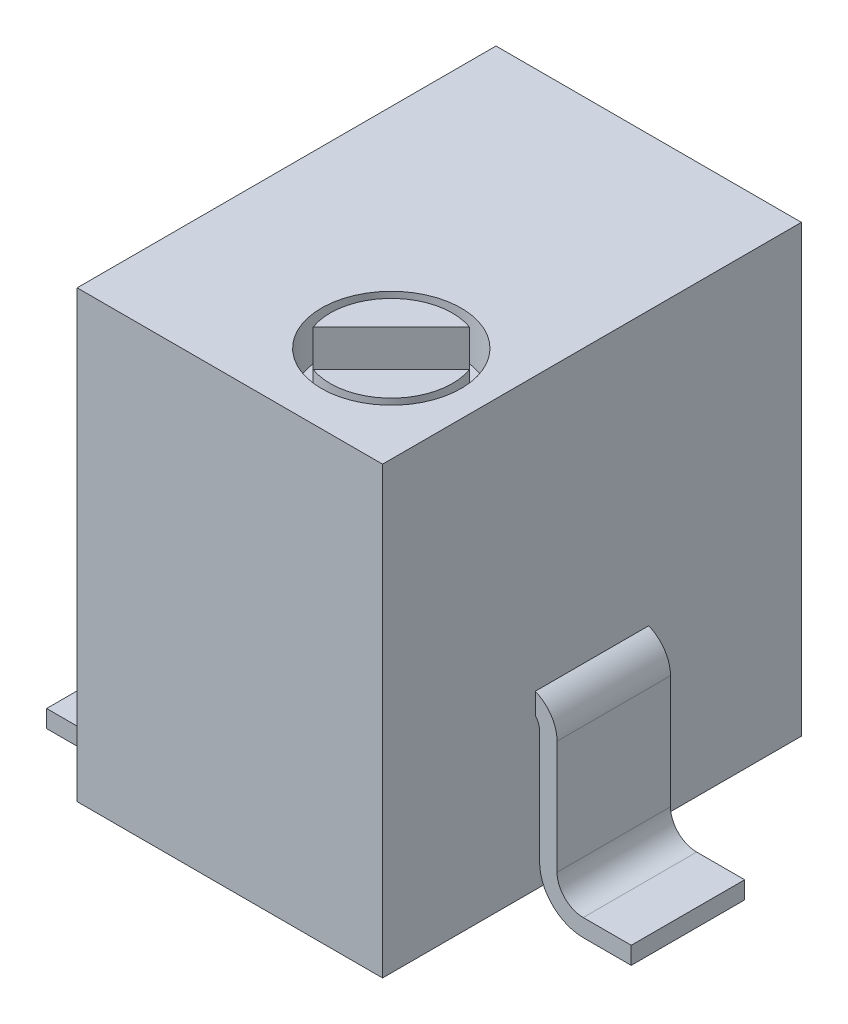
from build123d import *

# Parameters (mm, degrees)
EXTRUDE_1_DEPTH     = 1.65
EXTRUDE_START       = 0.2
SKETCH_2_W          = 3.5
SKETCH_2_H          = 4.8
EXTRUDE_2_DEPTH     = 5.1
SKETCH_3_W          = 1.1
SKETCH_3_H          = 1.7
SKETCH_3_H_2        = 1
CUT_EXTRUDE_1_DEPTH = 7.47861868
SKETCH_4_R          = 0.8
CUT_EXTRUDE_2_DEPTH = 0.5


with BuildPart() as part:
    # Sketch 1 → Extrude 1 (new, symmetric)
    with BuildSketch(Plane.XY):
        with BuildLine():
            Line((-2.85, 0), (-2.3, 0))
            ThreePointArc((-2.3, 0), (-1.946446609, 0.146446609), (-1.8, 0.5))
            Line((-1.8, 0.5), (-1.8, 1.8))
            ThreePointArc((-1.8, 1.8), (-1.741421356, 1.941421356), (-1.6, 2))
            Line((-1.6, 2), (1.6, 2))
            ThreePointArc((1.6, 2), (1.741421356, 1.941421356), (1.8, 1.8))
            Line((1.8, 1.8), (1.8, 0.5))
            ThreePointArc((1.8, 0.5), (1.946446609, 0.146446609), (2.3, 0))
            Line((2.3, 0), (2.85, 0))
            Line((2.85, 0), (2.85, 0.2))
            Line((2.85, 0.2), (2.3, 0.2))
            ThreePointArc((2.3, 0.2), (2.087867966, 0.287867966), (2, 0.5))
            Line((2, 0.5), (2, 1.8))
            ThreePointArc((2, 1.8), (1.882842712, 2.082842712), (1.6, 2.2))
            Line((1.6, 2.2), (-1.6, 2.2))
            ThreePointArc((-1.6, 2.2), (-1.882842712, 2.082842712), (-2, 1.8))
            Line((-2, 1.8), (-2, 0.5))
            ThreePointArc((-2, 0.5), (-2.087867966, 0.287867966), (-2.3, 0.2))
            Line((-2.3, 0.2), (-2.85, 0.2))
            Line((-2.85, 0.2), (-2.85, 0))
        make_face()
    extrude(amount=EXTRUDE_1_DEPTH, both=True)

    # Sketch 2 → Extrude 2 (add)
    with BuildSketch(Plane(origin=(0, 0, 0), x_dir=(1, 0, 0), z_dir=(0, 1, 0)).offset(EXTRUDE_START)):
        Rectangle(SKETCH_2_W, SKETCH_2_H)
    extrude(amount=EXTRUDE_2_DEPTH)

    # Sketch 3 → Cut-Extrude 1 (cut, through all)
    with BuildSketch(Plane(origin=(0, 0, 0), x_dir=(1, 0, 0), z_dir=(0, 1, 0))):
        with Locations((-2.3, 0)):
            Rectangle(SKETCH_3_W, SKETCH_3_H)
        with Locations((2.3, 1.15)):
            Rectangle(SKETCH_3_W, SKETCH_3_H_2)
        with Locations((2.3, -1.15)):
            Rectangle(SKETCH_3_W, SKETCH_3_H_2)
    extrude(amount=CUT_EXTRUDE_1_DEPTH, mode=Mode.SUBTRACT)

    # Sketch 4 → Cut-Extrude 2 (cut)
    with BuildSketch(Plane(origin=(0, 5.3, 0), x_dir=(-1, 0, 0), z_dir=(0, 1, 0))):
        with Locations(Location((-0.65, 1.2, 0), (0, 0, 90))):
            Circle(SKETCH_4_R)
        with BuildLine():
            Line((0.00934563, 1.435081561), (-0.885081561, 0.54065437))
            ThreePointArc((-0.885081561, 0.54065437), (-0.155025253, 0.705025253), (0.00934563, 1.435081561))
        make_face(mode=Mode.SUBTRACT)
        with BuildLine():
            Line((-0.414918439, 1.85934563), (-1.30934563, 0.964918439))
            ThreePointArc((-1.30934563, 0.964918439), (-1.144974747, 1.694974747), (-0.414918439, 1.85934563))
        make_face(mode=Mode.SUBTRACT)
    extrude(amount=-CUT_EXTRUDE_2_DEPTH, mode=Mode.SUBTRACT)


solid = part.part
